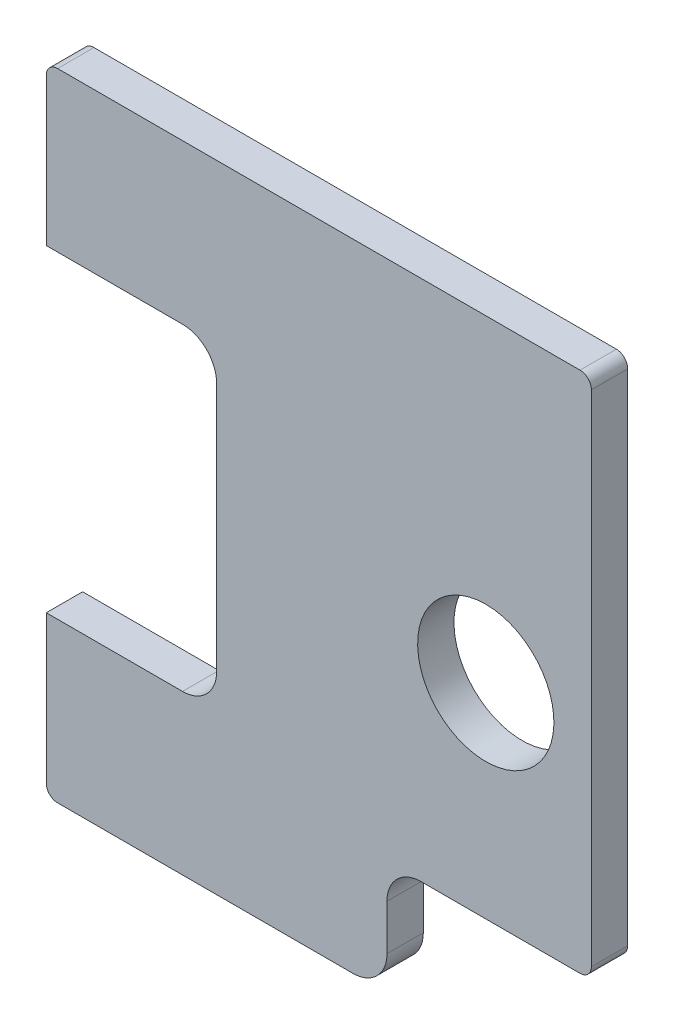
ISO-10303-21;
HEADER;
FILE_DESCRIPTION(('STEP AP214'),'2;1');
FILE_NAME('part.step','',(''),(''),'','','');
FILE_SCHEMA(('AUTOMOTIVE_DESIGN { 1 0 10303 214 1 1 1 1 }'));
ENDSEC;
DATA;
#1=APPLICATION_CONTEXT('core data for automotive mechanical design processes');
#2=APPLICATION_PROTOCOL_DEFINITION('international standard','automotive_design',2000,#1);
#3=PRODUCT_CONTEXT('',#1,'mechanical');
#4=PRODUCT('Part','Part','',(#3));
#5=PRODUCT_RELATED_PRODUCT_CATEGORY('part','',(#4));
#6=PRODUCT_DEFINITION_FORMATION('','',#4);
#7=PRODUCT_DEFINITION_CONTEXT('part definition',#1,'design');
#8=PRODUCT_DEFINITION('design','',#6,#7);
#9=PRODUCT_DEFINITION_SHAPE('','',#8);
#10=(LENGTH_UNIT() NAMED_UNIT(*) SI_UNIT(.MILLI.,.METRE.));
#11=(NAMED_UNIT(*) PLANE_ANGLE_UNIT() SI_UNIT($,.RADIAN.));
#12=(NAMED_UNIT(*) SI_UNIT($,.STERADIAN.) SOLID_ANGLE_UNIT());
#13=UNCERTAINTY_MEASURE_WITH_UNIT(LENGTH_MEASURE(1.E-05),#10,'distance_accuracy_value','');
#14=(GEOMETRIC_REPRESENTATION_CONTEXT(3) GLOBAL_UNCERTAINTY_ASSIGNED_CONTEXT((#13)) GLOBAL_UNIT_ASSIGNED_CONTEXT((#10,
#11,#12)) REPRESENTATION_CONTEXT('',''));
#15=CARTESIAN_POINT('',(0.,0.,0.));
#16=DIRECTION('',(0.,0.,1.));
#17=DIRECTION('',(1.,0.,0.));
#18=AXIS2_PLACEMENT_3D('',#15,#16,#17);
#19=CARTESIAN_POINT('',(-48.8,-24.7541746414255,-3.1));
#20=DIRECTION('',(0.,0.,1.));
#21=DIRECTION('',(0.,-1.,0.));
#22=AXIS2_PLACEMENT_3D('',#19,#20,#21);
#23=PLANE('',#22);
#24=DIRECTION('',(-1.,0.,0.));
#25=VECTOR('',#24,1.);
#26=CARTESIAN_POINT('',(-54.8,-23.2541746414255,-3.1));
#27=LINE('',#26,#25);
#28=CARTESIAN_POINT('',(-48.8,-23.2541746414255,-3.1));
#29=VERTEX_POINT('',#28);
#30=CARTESIAN_POINT('',(-54.8,-23.2541746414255,-3.1));
#31=VERTEX_POINT('',#30);
#32=EDGE_CURVE('E211',#29,#31,#27,.T.);
#33=ORIENTED_EDGE('',*,*,#32,.T.);
#34=DIRECTION('',(0.,1.,0.));
#35=VECTOR('',#34,1.);
#36=CARTESIAN_POINT('',(-54.8,-16.7541746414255,-3.1));
#37=LINE('',#36,#35);
#38=CARTESIAN_POINT('',(-54.8,-16.7541746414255,-3.1));
#39=VERTEX_POINT('',#38);
#40=EDGE_CURVE('E168',#31,#39,#37,.T.);
#41=ORIENTED_EDGE('',*,*,#40,.T.);
#42=CARTESIAN_POINT('',(-54.3,-16.7541746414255,-3.1));
#43=DIRECTION('',(0.,0.,-1.));
#44=DIRECTION('',(0.,-1.,0.));
#45=AXIS2_PLACEMENT_3D('',#42,#43,#44);
#46=CIRCLE('',#45,0.5);
#47=CARTESIAN_POINT('',(-54.3,-16.2541746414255,-3.1));
#48=VERTEX_POINT('',#47);
#49=EDGE_CURVE('E214',#39,#48,#46,.T.);
#50=ORIENTED_EDGE('',*,*,#49,.T.);
#51=DIRECTION('',(1.,0.,0.));
#52=VECTOR('',#51,1.);
#53=CARTESIAN_POINT('',(-31.3,-16.2541746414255,-3.1));
#54=LINE('',#53,#52);
#55=CARTESIAN_POINT('',(-31.3,-16.2541746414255,-3.1));
#56=VERTEX_POINT('',#55);
#57=EDGE_CURVE('E216',#48,#56,#54,.T.);
#58=ORIENTED_EDGE('',*,*,#57,.T.);
#59=CARTESIAN_POINT('',(-31.3,-16.7541746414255,-3.1));
#60=DIRECTION('',(0.,0.,-1.));
#61=DIRECTION('',(0.,-1.,0.));
#62=AXIS2_PLACEMENT_3D('',#59,#60,#61);
#63=CIRCLE('',#62,0.5);
#64=CARTESIAN_POINT('',(-30.8,-16.7541746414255,-3.1));
#65=VERTEX_POINT('',#64);
#66=EDGE_CURVE('E218',#56,#65,#63,.T.);
#67=ORIENTED_EDGE('',*,*,#66,.T.);
#68=DIRECTION('',(0.,-1.,0.));
#69=VECTOR('',#68,1.);
#70=CARTESIAN_POINT('',(-30.8,-38.7541746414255,-3.1));
#71=LINE('',#70,#69);
#72=CARTESIAN_POINT('',(-30.8,-38.7541746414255,-3.1));
#73=VERTEX_POINT('',#72);
#74=EDGE_CURVE('E220',#65,#73,#71,.T.);
#75=ORIENTED_EDGE('',*,*,#74,.T.);
#76=CARTESIAN_POINT('',(-31.3,-38.7541746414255,-3.1));
#77=DIRECTION('',(0.,0.,-1.));
#78=DIRECTION('',(0.,-1.,0.));
#79=AXIS2_PLACEMENT_3D('',#76,#77,#78);
#80=CIRCLE('',#79,0.500000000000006);
#81=CARTESIAN_POINT('',(-31.3,-39.2541746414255,-3.1));
#82=VERTEX_POINT('',#81);
#83=EDGE_CURVE('E222',#73,#82,#80,.T.);
#84=ORIENTED_EDGE('',*,*,#83,.T.);
#85=DIRECTION('',(-1.,0.,0.));
#86=VECTOR('',#85,1.);
#87=CARTESIAN_POINT('',(-38.3,-39.2541746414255,-3.1));
#88=LINE('',#87,#86);
#89=CARTESIAN_POINT('',(-38.3,-39.2541746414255,-3.1));
#90=VERTEX_POINT('',#89);
#91=EDGE_CURVE('E224',#82,#90,#88,.T.);
#92=ORIENTED_EDGE('',*,*,#91,.T.);
#93=CARTESIAN_POINT('',(-38.3,-40.7541746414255,-3.1));
#94=DIRECTION('',(0.,0.,1.));
#95=DIRECTION('',(0.,1.,0.));
#96=AXIS2_PLACEMENT_3D('',#93,#94,#95);
#97=CIRCLE('',#96,1.5);
#98=CARTESIAN_POINT('',(-39.8,-40.7541746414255,-3.1));
#99=VERTEX_POINT('',#98);
#100=EDGE_CURVE('E226',#90,#99,#97,.T.);
#101=ORIENTED_EDGE('',*,*,#100,.T.);
#102=DIRECTION('',(0.,-1.,0.));
#103=VECTOR('',#102,1.);
#104=CARTESIAN_POINT('',(-39.8,-42.7541746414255,-3.1));
#105=LINE('',#104,#103);
#106=CARTESIAN_POINT('',(-39.8,-42.7541746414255,-3.1));
#107=VERTEX_POINT('',#106);
#108=EDGE_CURVE('E228',#99,#107,#105,.T.);
#109=ORIENTED_EDGE('',*,*,#108,.T.);
#110=CARTESIAN_POINT('',(-41.3,-42.7541746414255,-3.1));
#111=DIRECTION('',(0.,0.,-1.));
#112=DIRECTION('',(0.,-1.,0.));
#113=AXIS2_PLACEMENT_3D('',#110,#111,#112);
#114=CIRCLE('',#113,1.5);
#115=CARTESIAN_POINT('',(-41.3,-44.2541746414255,-3.1));
#116=VERTEX_POINT('',#115);
#117=EDGE_CURVE('E230',#107,#116,#114,.T.);
#118=ORIENTED_EDGE('',*,*,#117,.T.);
#119=DIRECTION('',(-1.,0.,0.));
#120=VECTOR('',#119,1.);
#121=CARTESIAN_POINT('',(-54.3,-44.2541746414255,-3.1));
#122=LINE('',#121,#120);
#123=CARTESIAN_POINT('',(-54.3,-44.2541746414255,-3.1));
#124=VERTEX_POINT('',#123);
#125=EDGE_CURVE('E232',#116,#124,#122,.T.);
#126=ORIENTED_EDGE('',*,*,#125,.T.);
#127=CARTESIAN_POINT('',(-54.3,-43.7541746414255,-3.1));
#128=DIRECTION('',(0.,0.,-1.));
#129=DIRECTION('',(0.,-1.,0.));
#130=AXIS2_PLACEMENT_3D('',#127,#128,#129);
#131=CIRCLE('',#130,0.5);
#132=CARTESIAN_POINT('',(-54.8,-43.7541746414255,-3.1));
#133=VERTEX_POINT('',#132);
#134=EDGE_CURVE('E234',#124,#133,#131,.T.);
#135=ORIENTED_EDGE('',*,*,#134,.T.);
#136=DIRECTION('',(0.,1.,0.));
#137=VECTOR('',#136,1.);
#138=CARTESIAN_POINT('',(-54.8,-37.2541746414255,-3.1));
#139=LINE('',#138,#137);
#140=CARTESIAN_POINT('',(-54.8,-37.2541746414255,-3.1));
#141=VERTEX_POINT('',#140);
#142=EDGE_CURVE('E236',#133,#141,#139,.T.);
#143=ORIENTED_EDGE('',*,*,#142,.T.);
#144=DIRECTION('',(1.,0.,0.));
#145=VECTOR('',#144,1.);
#146=CARTESIAN_POINT('',(-48.8,-37.2541746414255,-3.1));
#147=LINE('',#146,#145);
#148=CARTESIAN_POINT('',(-48.8,-37.2541746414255,-3.1));
#149=VERTEX_POINT('',#148);
#150=EDGE_CURVE('E238',#141,#149,#147,.T.);
#151=ORIENTED_EDGE('',*,*,#150,.T.);
#152=CARTESIAN_POINT('',(-48.8,-35.7541746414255,-3.1));
#153=DIRECTION('',(0.,0.,1.));
#154=DIRECTION('',(0.,-1.,0.));
#155=AXIS2_PLACEMENT_3D('',#152,#153,#154);
#156=CIRCLE('',#155,1.5);
#157=CARTESIAN_POINT('',(-47.3,-35.7541746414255,-3.1));
#158=VERTEX_POINT('',#157);
#159=EDGE_CURVE('E240',#149,#158,#156,.T.);
#160=ORIENTED_EDGE('',*,*,#159,.T.);
#161=DIRECTION('',(0.,1.,0.));
#162=VECTOR('',#161,1.);
#163=CARTESIAN_POINT('',(-47.3,-24.7541746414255,-3.1));
#164=LINE('',#163,#162);
#165=CARTESIAN_POINT('',(-47.3,-24.7541746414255,-3.1));
#166=VERTEX_POINT('',#165);
#167=EDGE_CURVE('E49',#158,#166,#164,.T.);
#168=ORIENTED_EDGE('',*,*,#167,.T.);
#169=CARTESIAN_POINT('',(-48.8,-24.7541746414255,-3.1));
#170=DIRECTION('',(0.,0.,1.));
#171=DIRECTION('',(0.,-1.,0.));
#172=AXIS2_PLACEMENT_3D('',#169,#170,#171);
#173=CIRCLE('',#172,1.5);
#174=EDGE_CURVE('E44',#166,#29,#173,.T.);
#175=ORIENTED_EDGE('',*,*,#174,.T.);
#176=EDGE_LOOP('',(#33,#41,#50,#58,#67,#75,#84,#92,#101,#109,#118,#126,#135,#143,#151,#160,#168,#175));
#177=FACE_BOUND('',#176,.T.);
#178=CARTESIAN_POINT('',(-35.45,-30.2541746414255,-3.1));
#179=DIRECTION('',(0.,0.,-1.));
#180=DIRECTION('',(0.,1.,0.));
#181=AXIS2_PLACEMENT_3D('',#178,#179,#180);
#182=CIRCLE('',#181,3.);
#183=CARTESIAN_POINT('',(-35.45,-27.2541746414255,-3.1));
#184=VERTEX_POINT('',#183);
#185=EDGE_CURVE('E173',#184,#184,#182,.T.);
#186=ORIENTED_EDGE('',*,*,#185,.F.);
#187=EDGE_LOOP('',(#186));
#188=FACE_BOUND('',#187,.T.);
#189=ADVANCED_FACE('F29',(#177,#188),#23,.F.);
#190=CARTESIAN_POINT('',(-48.8,-24.7541746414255,-1.5));
#191=DIRECTION('',(0.,0.,1.));
#192=DIRECTION('',(0.,-1.,0.));
#193=AXIS2_PLACEMENT_3D('',#190,#191,#192);
#194=PLANE('',#193);
#195=DIRECTION('',(-1.,0.,0.));
#196=VECTOR('',#195,1.);
#197=CARTESIAN_POINT('',(-54.8,-23.2541746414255,-1.5));
#198=LINE('',#197,#196);
#199=CARTESIAN_POINT('',(-48.8,-23.2541746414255,-1.5));
#200=VERTEX_POINT('',#199);
#201=CARTESIAN_POINT('',(-54.8,-23.2541746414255,-1.5));
#202=VERTEX_POINT('',#201);
#203=EDGE_CURVE('E159',#200,#202,#198,.T.);
#204=ORIENTED_EDGE('',*,*,#203,.F.);
#205=CARTESIAN_POINT('',(-48.8,-24.7541746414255,-1.5));
#206=DIRECTION('',(0.,0.,1.));
#207=DIRECTION('',(0.,-1.,0.));
#208=AXIS2_PLACEMENT_3D('',#205,#206,#207);
#209=CIRCLE('',#208,1.5);
#210=CARTESIAN_POINT('',(-47.3,-24.7541746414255,-1.5));
#211=VERTEX_POINT('',#210);
#212=EDGE_CURVE('E209',#211,#200,#209,.T.);
#213=ORIENTED_EDGE('',*,*,#212,.F.);
#214=DIRECTION('',(0.,1.,0.));
#215=VECTOR('',#214,1.);
#216=CARTESIAN_POINT('',(-47.3,-24.7541746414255,-1.5));
#217=LINE('',#216,#215);
#218=CARTESIAN_POINT('',(-47.3,-35.7541746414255,-1.5));
#219=VERTEX_POINT('',#218);
#220=EDGE_CURVE('E207',#219,#211,#217,.T.);
#221=ORIENTED_EDGE('',*,*,#220,.F.);
#222=CARTESIAN_POINT('',(-48.8,-35.7541746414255,-1.5));
#223=DIRECTION('',(0.,0.,1.));
#224=DIRECTION('',(0.,-1.,0.));
#225=AXIS2_PLACEMENT_3D('',#222,#223,#224);
#226=CIRCLE('',#225,1.5);
#227=CARTESIAN_POINT('',(-48.8,-37.2541746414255,-1.5));
#228=VERTEX_POINT('',#227);
#229=EDGE_CURVE('E205',#228,#219,#226,.T.);
#230=ORIENTED_EDGE('',*,*,#229,.F.);
#231=DIRECTION('',(1.,0.,0.));
#232=VECTOR('',#231,1.);
#233=CARTESIAN_POINT('',(-48.8,-37.2541746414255,-1.5));
#234=LINE('',#233,#232);
#235=CARTESIAN_POINT('',(-54.8,-37.2541746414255,-1.5));
#236=VERTEX_POINT('',#235);
#237=EDGE_CURVE('E203',#236,#228,#234,.T.);
#238=ORIENTED_EDGE('',*,*,#237,.F.);
#239=DIRECTION('',(0.,1.,0.));
#240=VECTOR('',#239,1.);
#241=CARTESIAN_POINT('',(-54.8,-37.2541746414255,-1.5));
#242=LINE('',#241,#240);
#243=CARTESIAN_POINT('',(-54.8,-43.7541746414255,-1.5));
#244=VERTEX_POINT('',#243);
#245=EDGE_CURVE('E201',#244,#236,#242,.T.);
#246=ORIENTED_EDGE('',*,*,#245,.F.);
#247=CARTESIAN_POINT('',(-54.3,-43.7541746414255,-1.5));
#248=DIRECTION('',(0.,0.,-1.));
#249=DIRECTION('',(0.,-1.,0.));
#250=AXIS2_PLACEMENT_3D('',#247,#248,#249);
#251=CIRCLE('',#250,0.5);
#252=CARTESIAN_POINT('',(-54.3,-44.2541746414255,-1.5));
#253=VERTEX_POINT('',#252);
#254=EDGE_CURVE('E199',#253,#244,#251,.T.);
#255=ORIENTED_EDGE('',*,*,#254,.F.);
#256=DIRECTION('',(-1.,0.,0.));
#257=VECTOR('',#256,1.);
#258=CARTESIAN_POINT('',(-54.3,-44.2541746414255,-1.5));
#259=LINE('',#258,#257);
#260=CARTESIAN_POINT('',(-41.3,-44.2541746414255,-1.5));
#261=VERTEX_POINT('',#260);
#262=EDGE_CURVE('E197',#261,#253,#259,.T.);
#263=ORIENTED_EDGE('',*,*,#262,.F.);
#264=CARTESIAN_POINT('',(-41.3,-42.7541746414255,-1.5));
#265=DIRECTION('',(0.,0.,-1.));
#266=DIRECTION('',(0.,-1.,0.));
#267=AXIS2_PLACEMENT_3D('',#264,#265,#266);
#268=CIRCLE('',#267,1.5);
#269=CARTESIAN_POINT('',(-39.8,-42.7541746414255,-1.5));
#270=VERTEX_POINT('',#269);
#271=EDGE_CURVE('E195',#270,#261,#268,.T.);
#272=ORIENTED_EDGE('',*,*,#271,.F.);
#273=DIRECTION('',(0.,-1.,0.));
#274=VECTOR('',#273,1.);
#275=CARTESIAN_POINT('',(-39.8,-42.7541746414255,-1.5));
#276=LINE('',#275,#274);
#277=CARTESIAN_POINT('',(-39.8,-40.7541746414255,-1.5));
#278=VERTEX_POINT('',#277);
#279=EDGE_CURVE('E193',#278,#270,#276,.T.);
#280=ORIENTED_EDGE('',*,*,#279,.F.);
#281=CARTESIAN_POINT('',(-38.3,-40.7541746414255,-1.5));
#282=DIRECTION('',(0.,0.,1.));
#283=DIRECTION('',(0.,1.,0.));
#284=AXIS2_PLACEMENT_3D('',#281,#282,#283);
#285=CIRCLE('',#284,1.5);
#286=CARTESIAN_POINT('',(-38.3,-39.2541746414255,-1.5));
#287=VERTEX_POINT('',#286);
#288=EDGE_CURVE('E191',#287,#278,#285,.T.);
#289=ORIENTED_EDGE('',*,*,#288,.F.);
#290=DIRECTION('',(-1.,0.,0.));
#291=VECTOR('',#290,1.);
#292=CARTESIAN_POINT('',(-38.3,-39.2541746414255,-1.5));
#293=LINE('',#292,#291);
#294=CARTESIAN_POINT('',(-31.3,-39.2541746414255,-1.5));
#295=VERTEX_POINT('',#294);
#296=EDGE_CURVE('E189',#295,#287,#293,.T.);
#297=ORIENTED_EDGE('',*,*,#296,.F.);
#298=CARTESIAN_POINT('',(-31.3,-38.7541746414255,-1.5));
#299=DIRECTION('',(0.,0.,-1.));
#300=DIRECTION('',(0.,-1.,0.));
#301=AXIS2_PLACEMENT_3D('',#298,#299,#300);
#302=CIRCLE('',#301,0.500000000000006);
#303=CARTESIAN_POINT('',(-30.8,-38.7541746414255,-1.5));
#304=VERTEX_POINT('',#303);
#305=EDGE_CURVE('E187',#304,#295,#302,.T.);
#306=ORIENTED_EDGE('',*,*,#305,.F.);
#307=DIRECTION('',(0.,-1.,0.));
#308=VECTOR('',#307,1.);
#309=CARTESIAN_POINT('',(-30.8,-38.7541746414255,-1.5));
#310=LINE('',#309,#308);
#311=CARTESIAN_POINT('',(-30.8,-16.7541746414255,-1.5));
#312=VERTEX_POINT('',#311);
#313=EDGE_CURVE('E185',#312,#304,#310,.T.);
#314=ORIENTED_EDGE('',*,*,#313,.F.);
#315=CARTESIAN_POINT('',(-31.3,-16.7541746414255,-1.5));
#316=DIRECTION('',(0.,0.,-1.));
#317=DIRECTION('',(0.,-1.,0.));
#318=AXIS2_PLACEMENT_3D('',#315,#316,#317);
#319=CIRCLE('',#318,0.5);
#320=CARTESIAN_POINT('',(-31.3,-16.2541746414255,-1.5));
#321=VERTEX_POINT('',#320);
#322=EDGE_CURVE('E183',#321,#312,#319,.T.);
#323=ORIENTED_EDGE('',*,*,#322,.F.);
#324=DIRECTION('',(1.,0.,0.));
#325=VECTOR('',#324,1.);
#326=CARTESIAN_POINT('',(-31.3,-16.2541746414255,-1.5));
#327=LINE('',#326,#325);
#328=CARTESIAN_POINT('',(-54.3,-16.2541746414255,-1.5));
#329=VERTEX_POINT('',#328);
#330=EDGE_CURVE('E181',#329,#321,#327,.T.);
#331=ORIENTED_EDGE('',*,*,#330,.F.);
#332=CARTESIAN_POINT('',(-54.3,-16.7541746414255,-1.5));
#333=DIRECTION('',(0.,0.,-1.));
#334=DIRECTION('',(0.,-1.,0.));
#335=AXIS2_PLACEMENT_3D('',#332,#333,#334);
#336=CIRCLE('',#335,0.5);
#337=CARTESIAN_POINT('',(-54.8,-16.7541746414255,-1.5));
#338=VERTEX_POINT('',#337);
#339=EDGE_CURVE('E161',#338,#329,#336,.T.);
#340=ORIENTED_EDGE('',*,*,#339,.F.);
#341=DIRECTION('',(0.,1.,0.));
#342=VECTOR('',#341,1.);
#343=CARTESIAN_POINT('',(-54.8,-16.7541746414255,-1.5));
#344=LINE('',#343,#342);
#345=EDGE_CURVE('E154',#202,#338,#344,.T.);
#346=ORIENTED_EDGE('',*,*,#345,.F.);
#347=EDGE_LOOP('',(#204,#213,#221,#230,#238,#246,#255,#263,#272,#280,#289,#297,#306,#314,#323,
#331,#340,#346));
#348=FACE_BOUND('',#347,.T.);
#349=CARTESIAN_POINT('',(-35.45,-30.2541746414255,-1.5));
#350=DIRECTION('',(0.,0.,-1.));
#351=DIRECTION('',(0.,1.,0.));
#352=AXIS2_PLACEMENT_3D('',#349,#350,#351);
#353=CIRCLE('',#352,3.);
#354=CARTESIAN_POINT('',(-35.45,-27.2541746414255,-1.5));
#355=VERTEX_POINT('',#354);
#356=EDGE_CURVE('E176',#355,#355,#353,.T.);
#357=ORIENTED_EDGE('',*,*,#356,.T.);
#358=EDGE_LOOP('',(#357));
#359=FACE_BOUND('',#358,.T.);
#360=ADVANCED_FACE('F155',(#348,#359),#194,.T.);
#361=CARTESIAN_POINT('',(-54.8,-23.2541746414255,-3.1));
#362=DIRECTION('',(0.,1.,0.));
#363=DIRECTION('',(-1.,0.,0.));
#364=AXIS2_PLACEMENT_3D('',#361,#362,#363);
#365=PLANE('',#364);
#366=ORIENTED_EDGE('',*,*,#203,.T.);
#367=DIRECTION('',(0.,0.,1.));
#368=VECTOR('',#367,1.);
#369=CARTESIAN_POINT('',(-54.8,-23.2541746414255,-3.1));
#370=LINE('',#369,#368);
#371=EDGE_CURVE('E11',#31,#202,#370,.T.);
#372=ORIENTED_EDGE('',*,*,#371,.F.);
#373=ORIENTED_EDGE('',*,*,#32,.F.);
#374=DIRECTION('',(0.,0.,1.));
#375=VECTOR('',#374,1.);
#376=CARTESIAN_POINT('',(-48.8,-23.2541746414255,-3.1));
#377=LINE('',#376,#375);
#378=EDGE_CURVE('E172',#29,#200,#377,.T.);
#379=ORIENTED_EDGE('',*,*,#378,.T.);
#380=EDGE_LOOP('',(#366,#372,#373,#379));
#381=FACE_BOUND('',#380,.T.);
#382=ADVANCED_FACE('F31',(#381),#365,.F.);
#383=CARTESIAN_POINT('',(-54.8,-16.7541746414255,-3.1));
#384=DIRECTION('',(1.,0.,0.));
#385=DIRECTION('',(0.,0.,-1.));
#386=AXIS2_PLACEMENT_3D('',#383,#384,#385);
#387=PLANE('',#386);
#388=ORIENTED_EDGE('',*,*,#345,.T.);
#389=DIRECTION('',(0.,0.,1.));
#390=VECTOR('',#389,1.);
#391=CARTESIAN_POINT('',(-54.8,-16.7541746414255,-3.1));
#392=LINE('',#391,#390);
#393=EDGE_CURVE('E37',#39,#338,#392,.T.);
#394=ORIENTED_EDGE('',*,*,#393,.F.);
#395=ORIENTED_EDGE('',*,*,#40,.F.);
#396=ORIENTED_EDGE('',*,*,#371,.T.);
#397=EDGE_LOOP('',(#388,#394,#395,#396));
#398=FACE_BOUND('',#397,.T.);
#399=ADVANCED_FACE('F167',(#398),#387,.F.);
#400=CARTESIAN_POINT('',(-54.3,-16.7541746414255,-3.1));
#401=DIRECTION('',(0.,0.,1.));
#402=DIRECTION('',(0.,-1.,0.));
#403=AXIS2_PLACEMENT_3D('',#400,#401,#402);
#404=CYLINDRICAL_SURFACE('',#403,0.5);
#405=ORIENTED_EDGE('',*,*,#339,.T.);
#406=DIRECTION('',(0.,0.,1.));
#407=VECTOR('',#406,1.);
#408=CARTESIAN_POINT('',(-54.3,-16.2541746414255,-3.1));
#409=LINE('',#408,#407);
#410=EDGE_CURVE('E287',#48,#329,#409,.T.);
#411=ORIENTED_EDGE('',*,*,#410,.F.);
#412=ORIENTED_EDGE('',*,*,#49,.F.);
#413=ORIENTED_EDGE('',*,*,#393,.T.);
#414=EDGE_LOOP('',(#405,#411,#412,#413));
#415=FACE_BOUND('',#414,.T.);
#416=ADVANCED_FACE('F291',(#415),#404,.T.);
#417=CARTESIAN_POINT('',(-31.3,-16.2541746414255,-3.1));
#418=DIRECTION('',(0.,-1.,0.));
#419=DIRECTION('',(0.,0.,-1.));
#420=AXIS2_PLACEMENT_3D('',#417,#418,#419);
#421=PLANE('',#420);
#422=ORIENTED_EDGE('',*,*,#330,.T.);
#423=DIRECTION('',(0.,0.,1.));
#424=VECTOR('',#423,1.);
#425=CARTESIAN_POINT('',(-31.3,-16.2541746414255,-3.1));
#426=LINE('',#425,#424);
#427=EDGE_CURVE('E284',#56,#321,#426,.T.);
#428=ORIENTED_EDGE('',*,*,#427,.F.);
#429=ORIENTED_EDGE('',*,*,#57,.F.);
#430=ORIENTED_EDGE('',*,*,#410,.T.);
#431=EDGE_LOOP('',(#422,#428,#429,#430));
#432=FACE_BOUND('',#431,.T.);
#433=ADVANCED_FACE('F299',(#432),#421,.F.);
#434=CARTESIAN_POINT('',(-31.3,-16.7541746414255,-3.1));
#435=DIRECTION('',(0.,0.,1.));
#436=DIRECTION('',(0.,-1.,0.));
#437=AXIS2_PLACEMENT_3D('',#434,#435,#436);
#438=CYLINDRICAL_SURFACE('',#437,0.5);
#439=ORIENTED_EDGE('',*,*,#322,.T.);
#440=DIRECTION('',(0.,0.,1.));
#441=VECTOR('',#440,1.);
#442=CARTESIAN_POINT('',(-30.8,-16.7541746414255,-3.1));
#443=LINE('',#442,#441);
#444=EDGE_CURVE('E281',#65,#312,#443,.T.);
#445=ORIENTED_EDGE('',*,*,#444,.F.);
#446=ORIENTED_EDGE('',*,*,#66,.F.);
#447=ORIENTED_EDGE('',*,*,#427,.T.);
#448=EDGE_LOOP('',(#439,#445,#446,#447));
#449=FACE_BOUND('',#448,.T.);
#450=ADVANCED_FACE('F302',(#449),#438,.T.);
#451=CARTESIAN_POINT('',(-30.8,-38.7541746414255,-3.1));
#452=DIRECTION('',(-1.,0.,0.));
#453=DIRECTION('',(0.,-1.,0.));
#454=AXIS2_PLACEMENT_3D('',#451,#452,#453);
#455=PLANE('',#454);
#456=ORIENTED_EDGE('',*,*,#313,.T.);
#457=DIRECTION('',(0.,0.,1.));
#458=VECTOR('',#457,1.);
#459=CARTESIAN_POINT('',(-30.8,-38.7541746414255,-3.1));
#460=LINE('',#459,#458);
#461=EDGE_CURVE('E278',#73,#304,#460,.T.);
#462=ORIENTED_EDGE('',*,*,#461,.F.);
#463=ORIENTED_EDGE('',*,*,#74,.F.);
#464=ORIENTED_EDGE('',*,*,#444,.T.);
#465=EDGE_LOOP('',(#456,#462,#463,#464));
#466=FACE_BOUND('',#465,.T.);
#467=ADVANCED_FACE('F307',(#466),#455,.F.);
#468=CARTESIAN_POINT('',(-31.3,-38.7541746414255,-3.1));
#469=DIRECTION('',(0.,0.,1.));
#470=DIRECTION('',(0.,-1.,0.));
#471=AXIS2_PLACEMENT_3D('',#468,#469,#470);
#472=CYLINDRICAL_SURFACE('',#471,0.500000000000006);
#473=ORIENTED_EDGE('',*,*,#305,.T.);
#474=DIRECTION('',(0.,0.,1.));
#475=VECTOR('',#474,1.);
#476=CARTESIAN_POINT('',(-31.3,-39.2541746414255,-3.1));
#477=LINE('',#476,#475);
#478=EDGE_CURVE('E275',#82,#295,#477,.T.);
#479=ORIENTED_EDGE('',*,*,#478,.F.);
#480=ORIENTED_EDGE('',*,*,#83,.F.);
#481=ORIENTED_EDGE('',*,*,#461,.T.);
#482=EDGE_LOOP('',(#473,#479,#480,#481));
#483=FACE_BOUND('',#482,.T.);
#484=ADVANCED_FACE('F313',(#483),#472,.T.);
#485=CARTESIAN_POINT('',(-38.3,-39.2541746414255,-3.1));
#486=DIRECTION('',(0.,1.,0.));
#487=DIRECTION('',(0.,0.,1.));
#488=AXIS2_PLACEMENT_3D('',#485,#486,#487);
#489=PLANE('',#488);
#490=ORIENTED_EDGE('',*,*,#296,.T.);
#491=DIRECTION('',(0.,0.,1.));
#492=VECTOR('',#491,1.);
#493=CARTESIAN_POINT('',(-38.3,-39.2541746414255,-3.1));
#494=LINE('',#493,#492);
#495=EDGE_CURVE('E272',#90,#287,#494,.T.);
#496=ORIENTED_EDGE('',*,*,#495,.F.);
#497=ORIENTED_EDGE('',*,*,#91,.F.);
#498=ORIENTED_EDGE('',*,*,#478,.T.);
#499=EDGE_LOOP('',(#490,#496,#497,#498));
#500=FACE_BOUND('',#499,.T.);
#501=ADVANCED_FACE('F317',(#500),#489,.F.);
#502=CARTESIAN_POINT('',(-38.3,-40.7541746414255,-3.1));
#503=DIRECTION('',(0.,0.,1.));
#504=DIRECTION('',(0.,-1.,0.));
#505=AXIS2_PLACEMENT_3D('',#502,#503,#504);
#506=CYLINDRICAL_SURFACE('',#505,1.5);
#507=ORIENTED_EDGE('',*,*,#288,.T.);
#508=DIRECTION('',(0.,0.,1.));
#509=VECTOR('',#508,1.);
#510=CARTESIAN_POINT('',(-39.8,-40.7541746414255,-3.1));
#511=LINE('',#510,#509);
#512=EDGE_CURVE('E269',#99,#278,#511,.T.);
#513=ORIENTED_EDGE('',*,*,#512,.F.);
#514=ORIENTED_EDGE('',*,*,#100,.F.);
#515=ORIENTED_EDGE('',*,*,#495,.T.);
#516=EDGE_LOOP('',(#507,#513,#514,#515));
#517=FACE_BOUND('',#516,.T.);
#518=ADVANCED_FACE('F322',(#517),#506,.F.);
#519=CARTESIAN_POINT('',(-39.8,-42.7541746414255,-3.1));
#520=DIRECTION('',(-1.,0.,0.));
#521=DIRECTION('',(0.,0.,1.));
#522=AXIS2_PLACEMENT_3D('',#519,#520,#521);
#523=PLANE('',#522);
#524=ORIENTED_EDGE('',*,*,#279,.T.);
#525=DIRECTION('',(0.,0.,1.));
#526=VECTOR('',#525,1.);
#527=CARTESIAN_POINT('',(-39.8,-42.7541746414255,-3.1));
#528=LINE('',#527,#526);
#529=EDGE_CURVE('E266',#107,#270,#528,.T.);
#530=ORIENTED_EDGE('',*,*,#529,.F.);
#531=ORIENTED_EDGE('',*,*,#108,.F.);
#532=ORIENTED_EDGE('',*,*,#512,.T.);
#533=EDGE_LOOP('',(#524,#530,#531,#532));
#534=FACE_BOUND('',#533,.T.);
#535=ADVANCED_FACE('F328',(#534),#523,.F.);
#536=CARTESIAN_POINT('',(-41.3,-42.7541746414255,-3.1));
#537=DIRECTION('',(0.,0.,1.));
#538=DIRECTION('',(0.,-1.,0.));
#539=AXIS2_PLACEMENT_3D('',#536,#537,#538);
#540=CYLINDRICAL_SURFACE('',#539,1.5);
#541=ORIENTED_EDGE('',*,*,#271,.T.);
#542=DIRECTION('',(0.,0.,1.));
#543=VECTOR('',#542,1.);
#544=CARTESIAN_POINT('',(-41.3,-44.2541746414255,-3.1));
#545=LINE('',#544,#543);
#546=EDGE_CURVE('E263',#116,#261,#545,.T.);
#547=ORIENTED_EDGE('',*,*,#546,.F.);
#548=ORIENTED_EDGE('',*,*,#117,.F.);
#549=ORIENTED_EDGE('',*,*,#529,.T.);
#550=EDGE_LOOP('',(#541,#547,#548,#549));
#551=FACE_BOUND('',#550,.T.);
#552=ADVANCED_FACE('F332',(#551),#540,.T.);
#553=CARTESIAN_POINT('',(-54.3,-44.2541746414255,-3.1));
#554=DIRECTION('',(0.,1.,0.));
#555=DIRECTION('',(0.,0.,1.));
#556=AXIS2_PLACEMENT_3D('',#553,#554,#555);
#557=PLANE('',#556);
#558=ORIENTED_EDGE('',*,*,#262,.T.);
#559=DIRECTION('',(0.,0.,1.));
#560=VECTOR('',#559,1.);
#561=CARTESIAN_POINT('',(-54.3,-44.2541746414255,-3.1));
#562=LINE('',#561,#560);
#563=EDGE_CURVE('E260',#124,#253,#562,.T.);
#564=ORIENTED_EDGE('',*,*,#563,.F.);
#565=ORIENTED_EDGE('',*,*,#125,.F.);
#566=ORIENTED_EDGE('',*,*,#546,.T.);
#567=EDGE_LOOP('',(#558,#564,#565,#566));
#568=FACE_BOUND('',#567,.T.);
#569=ADVANCED_FACE('F337',(#568),#557,.F.);
#570=CARTESIAN_POINT('',(-54.3,-43.7541746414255,-3.1));
#571=DIRECTION('',(0.,0.,1.));
#572=DIRECTION('',(0.,-1.,0.));
#573=AXIS2_PLACEMENT_3D('',#570,#571,#572);
#574=CYLINDRICAL_SURFACE('',#573,0.5);
#575=ORIENTED_EDGE('',*,*,#254,.T.);
#576=DIRECTION('',(0.,0.,1.));
#577=VECTOR('',#576,1.);
#578=CARTESIAN_POINT('',(-54.8,-43.7541746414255,-3.1));
#579=LINE('',#578,#577);
#580=EDGE_CURVE('E257',#133,#244,#579,.T.);
#581=ORIENTED_EDGE('',*,*,#580,.F.);
#582=ORIENTED_EDGE('',*,*,#134,.F.);
#583=ORIENTED_EDGE('',*,*,#563,.T.);
#584=EDGE_LOOP('',(#575,#581,#582,#583));
#585=FACE_BOUND('',#584,.T.);
#586=ADVANCED_FACE('F343',(#585),#574,.T.);
#587=CARTESIAN_POINT('',(-54.8,-37.2541746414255,-3.1));
#588=DIRECTION('',(1.,0.,0.));
#589=DIRECTION('',(0.,0.,-1.));
#590=AXIS2_PLACEMENT_3D('',#587,#588,#589);
#591=PLANE('',#590);
#592=ORIENTED_EDGE('',*,*,#245,.T.);
#593=DIRECTION('',(0.,0.,1.));
#594=VECTOR('',#593,1.);
#595=CARTESIAN_POINT('',(-54.8,-37.2541746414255,-3.1));
#596=LINE('',#595,#594);
#597=EDGE_CURVE('E254',#141,#236,#596,.T.);
#598=ORIENTED_EDGE('',*,*,#597,.F.);
#599=ORIENTED_EDGE('',*,*,#142,.F.);
#600=ORIENTED_EDGE('',*,*,#580,.T.);
#601=EDGE_LOOP('',(#592,#598,#599,#600));
#602=FACE_BOUND('',#601,.T.);
#603=ADVANCED_FACE('F347',(#602),#591,.F.);
#604=CARTESIAN_POINT('',(-48.8,-37.2541746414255,-3.1));
#605=DIRECTION('',(0.,-1.,0.));
#606=DIRECTION('',(1.,0.,0.));
#607=AXIS2_PLACEMENT_3D('',#604,#605,#606);
#608=PLANE('',#607);
#609=ORIENTED_EDGE('',*,*,#237,.T.);
#610=DIRECTION('',(0.,0.,1.));
#611=VECTOR('',#610,1.);
#612=CARTESIAN_POINT('',(-48.8,-37.2541746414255,-3.1));
#613=LINE('',#612,#611);
#614=EDGE_CURVE('E251',#149,#228,#613,.T.);
#615=ORIENTED_EDGE('',*,*,#614,.F.);
#616=ORIENTED_EDGE('',*,*,#150,.F.);
#617=ORIENTED_EDGE('',*,*,#597,.T.);
#618=EDGE_LOOP('',(#609,#615,#616,#617));
#619=FACE_BOUND('',#618,.T.);
#620=ADVANCED_FACE('F352',(#619),#608,.F.);
#621=CARTESIAN_POINT('',(-48.8,-35.7541746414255,-3.1));
#622=DIRECTION('',(0.,0.,1.));
#623=DIRECTION('',(0.,-1.,0.));
#624=AXIS2_PLACEMENT_3D('',#621,#622,#623);
#625=CYLINDRICAL_SURFACE('',#624,1.5);
#626=ORIENTED_EDGE('',*,*,#229,.T.);
#627=DIRECTION('',(0.,0.,1.));
#628=VECTOR('',#627,1.);
#629=CARTESIAN_POINT('',(-47.3,-35.7541746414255,-3.1));
#630=LINE('',#629,#628);
#631=EDGE_CURVE('E248',#158,#219,#630,.T.);
#632=ORIENTED_EDGE('',*,*,#631,.F.);
#633=ORIENTED_EDGE('',*,*,#159,.F.);
#634=ORIENTED_EDGE('',*,*,#614,.T.);
#635=EDGE_LOOP('',(#626,#632,#633,#634));
#636=FACE_BOUND('',#635,.T.);
#637=ADVANCED_FACE('F356',(#636),#625,.F.);
#638=CARTESIAN_POINT('',(-47.3,-24.7541746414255,-3.1));
#639=DIRECTION('',(1.,0.,0.));
#640=DIRECTION('',(0.,1.,0.));
#641=AXIS2_PLACEMENT_3D('',#638,#639,#640);
#642=PLANE('',#641);
#643=ORIENTED_EDGE('',*,*,#220,.T.);
#644=DIRECTION('',(0.,0.,1.));
#645=VECTOR('',#644,1.);
#646=CARTESIAN_POINT('',(-47.3,-24.7541746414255,-3.1));
#647=LINE('',#646,#645);
#648=EDGE_CURVE('E245',#166,#211,#647,.T.);
#649=ORIENTED_EDGE('',*,*,#648,.F.);
#650=ORIENTED_EDGE('',*,*,#167,.F.);
#651=ORIENTED_EDGE('',*,*,#631,.T.);
#652=EDGE_LOOP('',(#643,#649,#650,#651));
#653=FACE_BOUND('',#652,.T.);
#654=ADVANCED_FACE('F360',(#653),#642,.F.);
#655=CARTESIAN_POINT('',(-48.8,-24.7541746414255,-3.1));
#656=DIRECTION('',(0.,0.,1.));
#657=DIRECTION('',(0.,-1.,0.));
#658=AXIS2_PLACEMENT_3D('',#655,#656,#657);
#659=CYLINDRICAL_SURFACE('',#658,1.5);
#660=ORIENTED_EDGE('',*,*,#212,.T.);
#661=ORIENTED_EDGE('',*,*,#378,.F.);
#662=ORIENTED_EDGE('',*,*,#174,.F.);
#663=ORIENTED_EDGE('',*,*,#648,.T.);
#664=EDGE_LOOP('',(#660,#661,#662,#663));
#665=FACE_BOUND('',#664,.T.);
#666=ADVANCED_FACE('F362',(#665),#659,.F.);
#667=CARTESIAN_POINT('',(-35.45,-30.2541746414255,-3.1));
#668=DIRECTION('',(0.,0.,1.));
#669=DIRECTION('',(0.,-1.,0.));
#670=AXIS2_PLACEMENT_3D('',#667,#668,#669);
#671=CYLINDRICAL_SURFACE('',#670,3.);
#672=ORIENTED_EDGE('',*,*,#185,.T.);
#673=EDGE_LOOP('',(#672));
#674=FACE_BOUND('',#673,.T.);
#675=ORIENTED_EDGE('',*,*,#356,.F.);
#676=EDGE_LOOP('',(#675));
#677=FACE_BOUND('',#676,.T.);
#678=ADVANCED_FACE('F364',(#674,#677),#671,.F.);
#679=CLOSED_SHELL('',(#189,#360,#382,#399,#416,#433,#450,#467,#484,#501,#518,#535,#552,#569,
#586,#603,#620,#637,#654,#666,#678));
#680=MANIFOLD_SOLID_BREP('B2',#679);
#681=ADVANCED_BREP_SHAPE_REPRESENTATION('',(#18,#680),#14);
#682=SHAPE_DEFINITION_REPRESENTATION(#9,#681);
ENDSEC;
END-ISO-10303-21;
